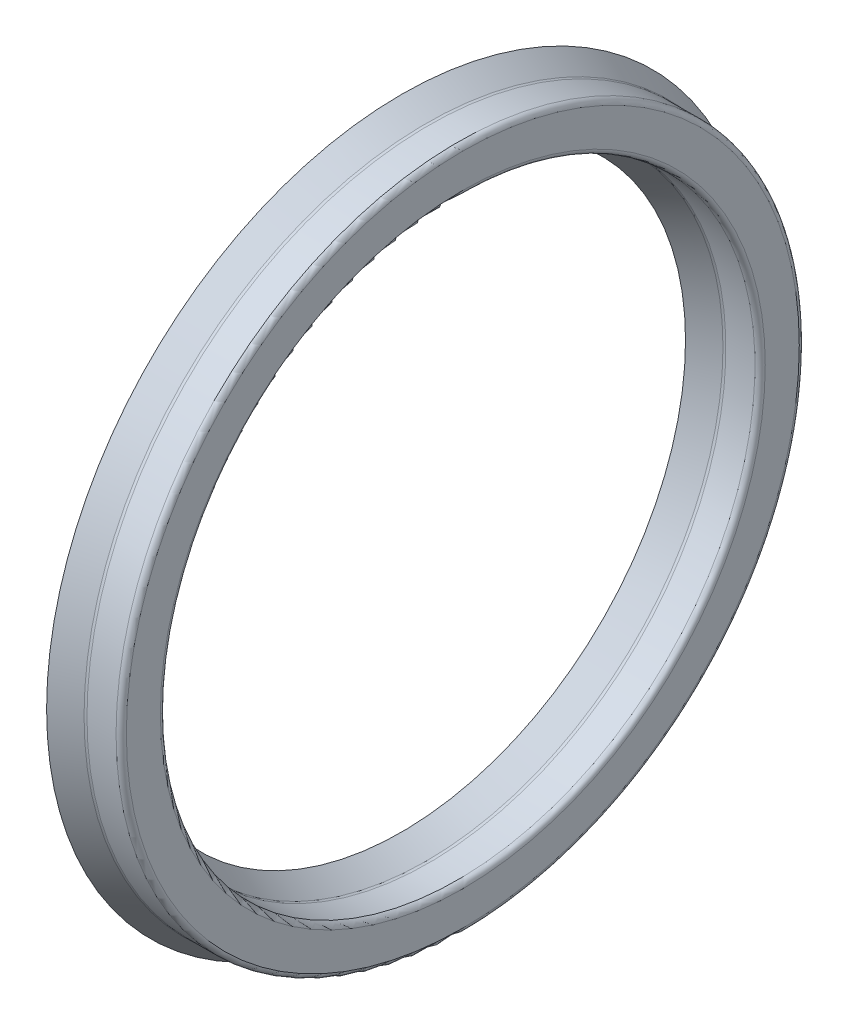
ISO-10303-21;
HEADER;
FILE_DESCRIPTION(('STEP AP214'),'2;1');
FILE_NAME('part.step','',(''),(''),'','','');
FILE_SCHEMA(('AUTOMOTIVE_DESIGN { 1 0 10303 214 1 1 1 1 }'));
ENDSEC;
DATA;
#1=APPLICATION_CONTEXT('core data for automotive mechanical design processes');
#2=APPLICATION_PROTOCOL_DEFINITION('international standard','automotive_design',2000,#1);
#3=PRODUCT_CONTEXT('',#1,'mechanical');
#4=PRODUCT('Part','Part','',(#3));
#5=PRODUCT_RELATED_PRODUCT_CATEGORY('part','',(#4));
#6=PRODUCT_DEFINITION_FORMATION('','',#4);
#7=PRODUCT_DEFINITION_CONTEXT('part definition',#1,'design');
#8=PRODUCT_DEFINITION('design','',#6,#7);
#9=PRODUCT_DEFINITION_SHAPE('','',#8);
#10=(LENGTH_UNIT() NAMED_UNIT(*) SI_UNIT(.MILLI.,.METRE.));
#11=(NAMED_UNIT(*) PLANE_ANGLE_UNIT() SI_UNIT($,.RADIAN.));
#12=(NAMED_UNIT(*) SI_UNIT($,.STERADIAN.) SOLID_ANGLE_UNIT());
#13=UNCERTAINTY_MEASURE_WITH_UNIT(LENGTH_MEASURE(1.E-05),#10,'distance_accuracy_value','');
#14=(GEOMETRIC_REPRESENTATION_CONTEXT(3) GLOBAL_UNCERTAINTY_ASSIGNED_CONTEXT((#13)) GLOBAL_UNIT_ASSIGNED_CONTEXT((#10,
#11,#12)) REPRESENTATION_CONTEXT('',''));
#15=CARTESIAN_POINT('',(0.,0.,0.));
#16=DIRECTION('',(0.,0.,1.));
#17=DIRECTION('',(1.,0.,0.));
#18=AXIS2_PLACEMENT_3D('',#15,#16,#17);
#19=CARTESIAN_POINT('',(-1.73443877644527,0.,0.));
#20=DIRECTION('',(1.,0.,0.));
#21=DIRECTION('',(0.,0.,-1.));
#22=AXIS2_PLACEMENT_3D('',#19,#20,#21);
#23=CONICAL_SURFACE('',#22,23.8125,1.09308222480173);
#24=CARTESIAN_POINT('',(-2.37489999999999,0.,0.));
#25=DIRECTION('',(-1.,0.,0.));
#26=DIRECTION('',(0.,0.,1.));
#27=AXIS2_PLACEMENT_3D('',#24,#25,#26);
#28=CIRCLE('',#27,22.575393);
#29=CARTESIAN_POINT('',(-2.37489999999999,0.,-22.575393));
#30=VERTEX_POINT('',#29);
#31=EDGE_CURVE('E10',#30,#30,#28,.T.);
#32=CARTESIAN_POINT('',(-1.73443877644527,0.,0.));
#33=DIRECTION('',(-1.,0.,0.));
#34=DIRECTION('',(0.,0.,1.));
#35=AXIS2_PLACEMENT_3D('',#32,#33,#34);
#36=CIRCLE('',#35,23.8125);
#37=CARTESIAN_POINT('',(-1.73443877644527,0.,-23.8125));
#38=VERTEX_POINT('',#37);
#39=EDGE_CURVE('E100',#38,#38,#36,.T.);
#40=CARTESIAN_POINT('',(-2.37489999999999,0.,-22.575393));
#41=CARTESIAN_POINT('',(-2.36822852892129,0.,-22.58827953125));
#42=CARTESIAN_POINT('',(-2.3615570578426,0.,-22.6011660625));
#43=CARTESIAN_POINT('',(-2.34821411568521,0.,-22.626939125));
#44=CARTESIAN_POINT('',(-2.34154264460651,0.,-22.63982565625));
#45=CARTESIAN_POINT('',(-2.32819970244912,0.,-22.66559871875));
#46=CARTESIAN_POINT('',(-2.32152823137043,0.,-22.67848525));
#47=CARTESIAN_POINT('',(-2.30818528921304,0.,-22.7042583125));
#48=CARTESIAN_POINT('',(-2.30151381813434,0.,-22.71714484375));
#49=CARTESIAN_POINT('',(-2.28817087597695,0.,-22.74291790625));
#50=CARTESIAN_POINT('',(-2.28149940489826,0.,-22.7558044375));
#51=CARTESIAN_POINT('',(-2.26815646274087,0.,-22.7815775));
#52=CARTESIAN_POINT('',(-2.26148499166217,0.,-22.79446403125));
#53=CARTESIAN_POINT('',(-2.24814204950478,0.,-22.82023709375));
#54=CARTESIAN_POINT('',(-2.24147057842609,0.,-22.833123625));
#55=CARTESIAN_POINT('',(-2.2281276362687,0.,-22.8588966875));
#56=CARTESIAN_POINT('',(-2.22145616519,0.,-22.87178321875));
#57=CARTESIAN_POINT('',(-2.20811322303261,0.,-22.89755628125));
#58=CARTESIAN_POINT('',(-2.20144175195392,0.,-22.9104428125));
#59=CARTESIAN_POINT('',(-2.18809880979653,0.,-22.936215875));
#60=CARTESIAN_POINT('',(-2.18142733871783,0.,-22.94910240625));
#61=CARTESIAN_POINT('',(-2.16808439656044,0.,-22.97487546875));
#62=CARTESIAN_POINT('',(-2.16141292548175,0.,-22.987762));
#63=CARTESIAN_POINT('',(-2.14806998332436,0.,-23.0135350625));
#64=CARTESIAN_POINT('',(-2.14139851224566,0.,-23.02642159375));
#65=CARTESIAN_POINT('',(-2.12805557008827,0.,-23.05219465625));
#66=CARTESIAN_POINT('',(-2.12138409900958,0.,-23.0650811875));
#67=CARTESIAN_POINT('',(-2.10804115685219,0.,-23.09085425));
#68=CARTESIAN_POINT('',(-2.10136968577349,0.,-23.10374078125));
#69=CARTESIAN_POINT('',(-2.0880267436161,0.,-23.12951384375));
#70=CARTESIAN_POINT('',(-2.08135527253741,0.,-23.142400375));
#71=CARTESIAN_POINT('',(-2.06801233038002,0.,-23.1681734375));
#72=CARTESIAN_POINT('',(-2.06134085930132,0.,-23.18105996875));
#73=CARTESIAN_POINT('',(-2.04799791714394,0.,-23.20683303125));
#74=CARTESIAN_POINT('',(-2.04132644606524,0.,-23.2197195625));
#75=CARTESIAN_POINT('',(-2.02798350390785,0.,-23.245492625));
#76=CARTESIAN_POINT('',(-2.02131203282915,0.,-23.25837915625));
#77=CARTESIAN_POINT('',(-2.00796909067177,0.,-23.28415221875));
#78=CARTESIAN_POINT('',(-2.00129761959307,0.,-23.29703875));
#79=CARTESIAN_POINT('',(-1.98795467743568,0.,-23.3228118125));
#80=CARTESIAN_POINT('',(-1.98128320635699,0.,-23.33569834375));
#81=CARTESIAN_POINT('',(-1.9679402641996,0.,-23.36147140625));
#82=CARTESIAN_POINT('',(-1.9612687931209,0.,-23.3743579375));
#83=CARTESIAN_POINT('',(-1.94792585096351,0.,-23.400131));
#84=CARTESIAN_POINT('',(-1.94125437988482,0.,-23.41301753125));
#85=CARTESIAN_POINT('',(-1.92791143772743,0.,-23.43879059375));
#86=CARTESIAN_POINT('',(-1.92123996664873,0.,-23.451677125));
#87=CARTESIAN_POINT('',(-1.90789702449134,0.,-23.4774501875));
#88=CARTESIAN_POINT('',(-1.90122555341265,0.,-23.49033671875));
#89=CARTESIAN_POINT('',(-1.88788261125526,0.,-23.51610978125));
#90=CARTESIAN_POINT('',(-1.88121114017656,0.,-23.5289963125));
#91=CARTESIAN_POINT('',(-1.86786819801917,0.,-23.554769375));
#92=CARTESIAN_POINT('',(-1.86119672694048,0.,-23.56765590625));
#93=CARTESIAN_POINT('',(-1.84785378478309,0.,-23.59342896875));
#94=CARTESIAN_POINT('',(-1.84118231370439,0.,-23.6063155));
#95=CARTESIAN_POINT('',(-1.827839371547,0.,-23.6320885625));
#96=CARTESIAN_POINT('',(-1.82116790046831,0.,-23.64497509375));
#97=CARTESIAN_POINT('',(-1.80782495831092,0.,-23.67074815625));
#98=CARTESIAN_POINT('',(-1.80115348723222,0.,-23.6836346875));
#99=CARTESIAN_POINT('',(-1.78781054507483,0.,-23.70940775));
#100=CARTESIAN_POINT('',(-1.78113907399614,0.,-23.72229428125));
#101=CARTESIAN_POINT('',(-1.76779613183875,0.,-23.74806734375));
#102=CARTESIAN_POINT('',(-1.76112466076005,0.,-23.760953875));
#103=CARTESIAN_POINT('',(-1.74778171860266,0.,-23.7867269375));
#104=CARTESIAN_POINT('',(-1.74111024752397,0.,-23.79961346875));
#105=CARTESIAN_POINT('',(-1.73443877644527,0.,-23.8125));
#106=B_SPLINE_CURVE_WITH_KNOTS('',3,(#40,#41,#42,#43,#44,#45,#46,#47,#48,#49,#50,#51,#52,#53,
#54,#55,#56,#57,#58,#59,#60,#61,#62,#63,#64,#65,#66,#67,#68,#69,#70,#71,#72,#73,#74,#75,#76,#77,
#78,#79,#80,#81,#82,#83,#84,#85,#86,#87,#88,#89,#90,#91,#92,#93,#94,#95,#96,#97,#98,#99,#100,
#101,#102,#103,#104,#105),.UNSPECIFIED.,.F.,.F.,(4,2,2,2,2,2,2,2,2,2,2,2,2,2,2,2,2,2,2,2,2,2,2,
2,2,2,2,2,2,2,2,2,4),(0.,0.0435332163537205,0.087066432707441,0.130599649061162,
0.174132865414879,0.217666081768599,0.26119929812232,0.304732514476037,0.348265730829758,
0.391798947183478,0.435332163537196,0.478865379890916,0.522398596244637,0.565931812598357,
0.609465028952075,0.652998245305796,0.696531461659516,0.740064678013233,0.783597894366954,
0.827131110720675,0.870664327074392,0.914197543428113,0.957730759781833,1.00126397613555,
1.04479719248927,1.08833040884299,1.13186362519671,1.17539684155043,1.21893005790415,
1.26246327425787,1.30599649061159,1.34952970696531,1.39306292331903),.UNSPECIFIED.);
#107=EDGE_CURVE('BSEAM39',#30,#38,#106,.T.);
#108=ORIENTED_EDGE('',*,*,#31,.F.);
#109=ORIENTED_EDGE('',*,*,#39,.T.);
#110=ORIENTED_EDGE('',*,*,#107,.T.);
#111=ORIENTED_EDGE('',*,*,#107,.F.);
#112=EDGE_LOOP('',(#108,#110,#109,#111));
#113=FACE_BOUND('',#112,.T.);
#114=ADVANCED_FACE('F39',(#113),#23,.T.);
#115=CARTESIAN_POINT('',(-2.37489999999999,0.,0.));
#116=DIRECTION('',(-1.,0.,0.));
#117=DIRECTION('',(0.,0.,1.));
#118=AXIS2_PLACEMENT_3D('',#115,#116,#117);
#119=CONICAL_SURFACE('',#118,22.575393,0.477714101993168);
#120=CARTESIAN_POINT('',(-0.756215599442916,0.,0.));
#121=DIRECTION('',(-1.,0.,0.));
#122=DIRECTION('',(0.,0.,1.));
#123=AXIS2_PLACEMENT_3D('',#120,#121,#122);
#124=CIRCLE('',#123,21.7373857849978);
#125=CARTESIAN_POINT('',(-0.756215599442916,0.,21.7373857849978));
#126=VERTEX_POINT('',#125);
#127=EDGE_CURVE('E46',#126,#126,#124,.T.);
#128=ORIENTED_EDGE('',*,*,#127,.F.);
#129=EDGE_LOOP('',(#128));
#130=FACE_BOUND('',#129,.T.);
#131=ORIENTED_EDGE('',*,*,#31,.T.);
#132=EDGE_LOOP('',(#131));
#133=FACE_BOUND('',#132,.T.);
#134=ADVANCED_FACE('F175',(#130,#133),#119,.F.);
#135=CARTESIAN_POINT('',(-0.914704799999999,0.,0.));
#136=DIRECTION('',(-1.,0.,0.));
#137=DIRECTION('',(0.,0.,1.));
#138=AXIS2_PLACEMENT_3D('',#135,#136,#137);
#139=TOROIDAL_SURFACE('',#138,21.43125,0.344728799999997);
#140=CARTESIAN_POINT('',(-0.756215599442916,0.,0.));
#141=DIRECTION('',(-1.,0.,0.));
#142=DIRECTION('',(0.,0.,1.));
#143=AXIS2_PLACEMENT_3D('',#140,#141,#142);
#144=CIRCLE('',#143,21.1251142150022);
#145=CARTESIAN_POINT('',(-0.756215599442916,0.,-21.1251142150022));
#146=VERTEX_POINT('',#145);
#147=EDGE_CURVE('E52',#146,#146,#144,.T.);
#148=ORIENTED_EDGE('',*,*,#147,.F.);
#149=EDGE_LOOP('',(#148));
#150=FACE_BOUND('',#149,.T.);
#151=ORIENTED_EDGE('',*,*,#127,.T.);
#152=EDGE_LOOP('',(#151));
#153=FACE_BOUND('',#152,.T.);
#154=ADVANCED_FACE('F170',(#150,#153),#139,.F.);
#155=CARTESIAN_POINT('',(-0.756215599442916,0.,0.));
#156=DIRECTION('',(1.,0.,0.));
#157=DIRECTION('',(0.,0.,-1.));
#158=AXIS2_PLACEMENT_3D('',#155,#156,#157);
#159=CONICAL_SURFACE('',#158,21.1251142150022,0.477714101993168);
#160=CARTESIAN_POINT('',(-2.37489999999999,0.,0.));
#161=DIRECTION('',(-1.,0.,0.));
#162=DIRECTION('',(0.,0.,1.));
#163=AXIS2_PLACEMENT_3D('',#160,#161,#162);
#164=CIRCLE('',#163,20.287107);
#165=CARTESIAN_POINT('',(-2.37489999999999,0.,-20.287107));
#166=VERTEX_POINT('',#165);
#167=EDGE_CURVE('E58',#166,#166,#164,.T.);
#168=CARTESIAN_POINT('',(-2.37489999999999,0.,-20.287107));
#169=CARTESIAN_POINT('',(-2.35803870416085,0.,-20.2958362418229));
#170=CARTESIAN_POINT('',(-2.34117740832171,0.,-20.3045654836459));
#171=CARTESIAN_POINT('',(-2.30745481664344,0.,-20.3220239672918));
#172=CARTESIAN_POINT('',(-2.2905935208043,0.,-20.3307532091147));
#173=CARTESIAN_POINT('',(-2.25687092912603,0.,-20.3482116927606));
#174=CARTESIAN_POINT('',(-2.2400096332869,0.,-20.3569409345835));
#175=CARTESIAN_POINT('',(-2.20628704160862,0.,-20.3743994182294));
#176=CARTESIAN_POINT('',(-2.18942574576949,0.,-20.3831286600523));
#177=CARTESIAN_POINT('',(-2.15570315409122,0.,-20.4005871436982));
#178=CARTESIAN_POINT('',(-2.13884185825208,0.,-20.4093163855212));
#179=CARTESIAN_POINT('',(-2.10511926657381,0.,-20.426774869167));
#180=CARTESIAN_POINT('',(-2.08825797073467,0.,-20.43550411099));
#181=CARTESIAN_POINT('',(-2.0545353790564,0.,-20.4529625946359));
#182=CARTESIAN_POINT('',(-2.03767408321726,0.,-20.4616918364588));
#183=CARTESIAN_POINT('',(-2.00395149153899,0.,-20.4791503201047));
#184=CARTESIAN_POINT('',(-1.98709019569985,0.,-20.4878795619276));
#185=CARTESIAN_POINT('',(-1.95336760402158,0.,-20.5053380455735));
#186=CARTESIAN_POINT('',(-1.93650630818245,0.,-20.5140672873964));
#187=CARTESIAN_POINT('',(-1.90278371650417,0.,-20.5315257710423));
#188=CARTESIAN_POINT('',(-1.88592242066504,0.,-20.5402550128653));
#189=CARTESIAN_POINT('',(-1.85219982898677,0.,-20.5577134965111));
#190=CARTESIAN_POINT('',(-1.83533853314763,0.,-20.5664427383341));
#191=CARTESIAN_POINT('',(-1.80161594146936,0.,-20.5839012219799));
#192=CARTESIAN_POINT('',(-1.78475464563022,0.,-20.5926304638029));
#193=CARTESIAN_POINT('',(-1.75103205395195,0.,-20.6100889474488));
#194=CARTESIAN_POINT('',(-1.73417075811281,0.,-20.6188181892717));
#195=CARTESIAN_POINT('',(-1.70044816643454,0.,-20.6362766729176));
#196=CARTESIAN_POINT('',(-1.6835868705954,0.,-20.6450059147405));
#197=CARTESIAN_POINT('',(-1.64986427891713,0.,-20.6624643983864));
#198=CARTESIAN_POINT('',(-1.633002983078,0.,-20.6711936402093));
#199=CARTESIAN_POINT('',(-1.59928039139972,0.,-20.6886521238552));
#200=CARTESIAN_POINT('',(-1.58241909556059,0.,-20.6973813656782));
#201=CARTESIAN_POINT('',(-1.54869650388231,0.,-20.714839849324));
#202=CARTESIAN_POINT('',(-1.53183520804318,0.,-20.723569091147));
#203=CARTESIAN_POINT('',(-1.49811261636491,0.,-20.7410275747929));
#204=CARTESIAN_POINT('',(-1.48125132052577,0.,-20.7497568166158));
#205=CARTESIAN_POINT('',(-1.4475287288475,0.,-20.7672153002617));
#206=CARTESIAN_POINT('',(-1.43066743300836,0.,-20.7759445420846));
#207=CARTESIAN_POINT('',(-1.39694484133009,0.,-20.7934030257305));
#208=CARTESIAN_POINT('',(-1.38008354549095,0.,-20.8021322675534));
#209=CARTESIAN_POINT('',(-1.34636095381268,0.,-20.8195907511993));
#210=CARTESIAN_POINT('',(-1.32949965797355,0.,-20.8283199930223));
#211=CARTESIAN_POINT('',(-1.29577706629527,0.,-20.8457784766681));
#212=CARTESIAN_POINT('',(-1.27891577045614,0.,-20.8545077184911));
#213=CARTESIAN_POINT('',(-1.24519317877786,0.,-20.871966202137));
#214=CARTESIAN_POINT('',(-1.22833188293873,0.,-20.8806954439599));
#215=CARTESIAN_POINT('',(-1.19460929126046,0.,-20.8981539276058));
#216=CARTESIAN_POINT('',(-1.17774799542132,0.,-20.9068831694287));
#217=CARTESIAN_POINT('',(-1.14402540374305,0.,-20.9243416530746));
#218=CARTESIAN_POINT('',(-1.12716410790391,0.,-20.9330708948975));
#219=CARTESIAN_POINT('',(-1.09344151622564,0.,-20.9505293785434));
#220=CARTESIAN_POINT('',(-1.0765802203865,0.,-20.9592586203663));
#221=CARTESIAN_POINT('',(-1.04285762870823,0.,-20.9767171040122));
#222=CARTESIAN_POINT('',(-1.02599633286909,0.,-20.9854463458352));
#223=CARTESIAN_POINT('',(-0.992273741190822,0.,-21.002904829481));
#224=CARTESIAN_POINT('',(-0.975412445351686,0.,-21.011634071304));
#225=CARTESIAN_POINT('',(-0.941689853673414,0.,-21.0290925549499));
#226=CARTESIAN_POINT('',(-0.924828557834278,0.,-21.0378217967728));
#227=CARTESIAN_POINT('',(-0.891105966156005,0.,-21.0552802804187));
#228=CARTESIAN_POINT('',(-0.874244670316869,0.,-21.0640095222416));
#229=CARTESIAN_POINT('',(-0.840522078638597,0.,-21.0814680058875));
#230=CARTESIAN_POINT('',(-0.823660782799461,0.,-21.0901972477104));
#231=CARTESIAN_POINT('',(-0.789938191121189,0.,-21.1076557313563));
#232=CARTESIAN_POINT('',(-0.773076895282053,0.,-21.1163849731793));
#233=CARTESIAN_POINT('',(-0.756215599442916,0.,-21.1251142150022));
#234=B_SPLINE_CURVE_WITH_KNOTS('',3,(#168,#169,#170,#171,#172,#173,#174,#175,#176,#177,#178,
#179,#180,#181,#182,#183,#184,#185,#186,#187,#188,#189,#190,#191,#192,#193,#194,#195,#196,#197,
#198,#199,#200,#201,#202,#203,#204,#205,#206,#207,#208,#209,#210,#211,#212,#213,#214,#215,#216,
#217,#218,#219,#220,#221,#222,#223,#224,#225,#226,#227,#228,#229,#230,#231,#232,#233),
.UNSPECIFIED.,.F.,.F.,(4,2,2,2,2,2,2,2,2,2,2,2,2,2,2,2,2,2,2,2,2,2,2,2,2,2,2,2,2,2,2,2,4),(0.,
0.0569607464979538,0.113921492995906,0.17088223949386,0.227842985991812,0.284803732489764,
0.341764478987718,0.39872522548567,0.455685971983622,0.512646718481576,0.569607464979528,
0.626568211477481,0.683528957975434,0.740489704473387,0.79745045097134,0.854411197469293,
0.911371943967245,0.968332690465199,1.02529343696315,1.0822541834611,1.13921492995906,
1.19617567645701,1.25313642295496,1.31009716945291,1.36705791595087,1.42401866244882,
1.48097940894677,1.53794015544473,1.59490090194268,1.65186164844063,1.70882239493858,
1.76578314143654,1.82274388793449),.UNSPECIFIED.);
#235=EDGE_CURVE('BSEAM164',#166,#146,#234,.T.);
#236=ORIENTED_EDGE('',*,*,#167,.F.);
#237=ORIENTED_EDGE('',*,*,#147,.T.);
#238=ORIENTED_EDGE('',*,*,#235,.T.);
#239=ORIENTED_EDGE('',*,*,#235,.F.);
#240=EDGE_LOOP('',(#236,#238,#237,#239));
#241=FACE_BOUND('',#240,.T.);
#242=ADVANCED_FACE('F164',(#241),#159,.T.);
#243=CARTESIAN_POINT('',(-2.37489999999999,0.,0.));
#244=DIRECTION('',(-1.,0.,0.));
#245=DIRECTION('',(0.,0.,1.));
#246=AXIS2_PLACEMENT_3D('',#243,#244,#245);
#247=CONICAL_SURFACE('',#246,20.287107,1.09308222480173);
#248=CARTESIAN_POINT('',(-1.73443877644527,0.,0.));
#249=DIRECTION('',(-1.,0.,0.));
#250=DIRECTION('',(0.,0.,1.));
#251=AXIS2_PLACEMENT_3D('',#248,#249,#250);
#252=CIRCLE('',#251,19.05);
#253=CARTESIAN_POINT('',(-1.73443877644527,0.,-19.05));
#254=VERTEX_POINT('',#253);
#255=EDGE_CURVE('E64',#254,#254,#252,.T.);
#256=ORIENTED_EDGE('',*,*,#255,.F.);
#257=EDGE_LOOP('',(#256));
#258=FACE_BOUND('',#257,.T.);
#259=ORIENTED_EDGE('',*,*,#167,.T.);
#260=EDGE_LOOP('',(#259));
#261=FACE_BOUND('',#260,.T.);
#262=ADVANCED_FACE('F158',(#258,#261),#247,.F.);
#263=CARTESIAN_POINT('',(-1.73443877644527,0.,0.));
#264=DIRECTION('',(1.,0.,0.));
#265=DIRECTION('',(0.,0.,-1.));
#266=AXIS2_PLACEMENT_3D('',#263,#264,#265);
#267=CONICAL_SURFACE('',#266,19.05,0.477714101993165);
#268=CARTESIAN_POINT('',(-0.0795375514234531,0.,0.));
#269=DIRECTION('',(-1.,0.,0.));
#270=DIRECTION('',(0.,0.,1.));
#271=AXIS2_PLACEMENT_3D('',#268,#269,#270);
#272=CIRCLE('',#271,19.9067569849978);
#273=CARTESIAN_POINT('',(-0.0795375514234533,0.,-19.9067569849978));
#274=VERTEX_POINT('',#273);
#275=EDGE_CURVE('E68',#274,#274,#272,.T.);
#276=CARTESIAN_POINT('',(-0.0795375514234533,0.,-19.9067569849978));
#277=CARTESIAN_POINT('',(-0.0967761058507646,0.,-19.8978324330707));
#278=CARTESIAN_POINT('',(-0.114014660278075,0.,-19.8889078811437));
#279=CARTESIAN_POINT('',(-0.148491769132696,0.,-19.8710587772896));
#280=CARTESIAN_POINT('',(-0.165730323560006,0.,-19.8621342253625));
#281=CARTESIAN_POINT('',(-0.200207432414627,0.,-19.8442851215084));
#282=CARTESIAN_POINT('',(-0.217445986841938,0.,-19.8353605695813));
#283=CARTESIAN_POINT('',(-0.25192309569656,0.,-19.8175114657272));
#284=CARTESIAN_POINT('',(-0.269161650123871,0.,-19.8085869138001));
#285=CARTESIAN_POINT('',(-0.303638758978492,0.,-19.790737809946));
#286=CARTESIAN_POINT('',(-0.320877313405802,0.,-19.781813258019));
#287=CARTESIAN_POINT('',(-0.355354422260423,0.,-19.7639641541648));
#288=CARTESIAN_POINT('',(-0.372592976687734,0.,-19.7550396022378));
#289=CARTESIAN_POINT('',(-0.407070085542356,0.,-19.7371904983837));
#290=CARTESIAN_POINT('',(-0.424308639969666,0.,-19.7282659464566));
#291=CARTESIAN_POINT('',(-0.458785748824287,0.,-19.7104168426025));
#292=CARTESIAN_POINT('',(-0.476024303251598,0.,-19.7014922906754));
#293=CARTESIAN_POINT('',(-0.510501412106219,0.,-19.6836431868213));
#294=CARTESIAN_POINT('',(-0.52773996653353,0.,-19.6747186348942));
#295=CARTESIAN_POINT('',(-0.562217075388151,0.,-19.6568695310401));
#296=CARTESIAN_POINT('',(-0.579455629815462,0.,-19.647944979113));
#297=CARTESIAN_POINT('',(-0.613932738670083,0.,-19.6300958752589));
#298=CARTESIAN_POINT('',(-0.631171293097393,0.,-19.6211713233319));
#299=CARTESIAN_POINT('',(-0.665648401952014,0.,-19.6033222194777));
#300=CARTESIAN_POINT('',(-0.682886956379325,0.,-19.5943976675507));
#301=CARTESIAN_POINT('',(-0.717364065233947,0.,-19.5765485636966));
#302=CARTESIAN_POINT('',(-0.734602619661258,0.,-19.5676240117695));
#303=CARTESIAN_POINT('',(-0.769079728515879,0.,-19.5497749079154));
#304=CARTESIAN_POINT('',(-0.786318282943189,0.,-19.5408503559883));
#305=CARTESIAN_POINT('',(-0.82079539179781,0.,-19.5230012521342));
#306=CARTESIAN_POINT('',(-0.838033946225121,0.,-19.5140767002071));
#307=CARTESIAN_POINT('',(-0.872511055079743,0.,-19.496227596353));
#308=CARTESIAN_POINT('',(-0.889749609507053,0.,-19.487303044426));
#309=CARTESIAN_POINT('',(-0.924226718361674,0.,-19.4694539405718));
#310=CARTESIAN_POINT('',(-0.941465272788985,0.,-19.4605293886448));
#311=CARTESIAN_POINT('',(-0.975942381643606,0.,-19.4426802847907));
#312=CARTESIAN_POINT('',(-0.993180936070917,0.,-19.4337557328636));
#313=CARTESIAN_POINT('',(-1.02765804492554,0.,-19.4159066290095));
#314=CARTESIAN_POINT('',(-1.04489659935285,0.,-19.4069820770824));
#315=CARTESIAN_POINT('',(-1.07937370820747,0.,-19.3891329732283));
#316=CARTESIAN_POINT('',(-1.09661226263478,0.,-19.3802084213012));
#317=CARTESIAN_POINT('',(-1.1310893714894,0.,-19.3623593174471));
#318=CARTESIAN_POINT('',(-1.14832792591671,0.,-19.3534347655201));
#319=CARTESIAN_POINT('',(-1.18280503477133,0.,-19.3355856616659));
#320=CARTESIAN_POINT('',(-1.20004358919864,0.,-19.3266611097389));
#321=CARTESIAN_POINT('',(-1.23452069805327,0.,-19.3088120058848));
#322=CARTESIAN_POINT('',(-1.25175925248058,0.,-19.2998874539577));
#323=CARTESIAN_POINT('',(-1.2862363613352,0.,-19.2820383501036));
#324=CARTESIAN_POINT('',(-1.30347491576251,0.,-19.2731137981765));
#325=CARTESIAN_POINT('',(-1.33795202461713,0.,-19.2552646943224));
#326=CARTESIAN_POINT('',(-1.35519057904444,0.,-19.2463401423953));
#327=CARTESIAN_POINT('',(-1.38966768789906,0.,-19.2284910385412));
#328=CARTESIAN_POINT('',(-1.40690624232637,0.,-19.2195664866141));
#329=CARTESIAN_POINT('',(-1.44138335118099,0.,-19.20171738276));
#330=CARTESIAN_POINT('',(-1.4586219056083,0.,-19.192792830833));
#331=CARTESIAN_POINT('',(-1.49309901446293,0.,-19.1749437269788));
#332=CARTESIAN_POINT('',(-1.51033756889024,0.,-19.1660191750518));
#333=CARTESIAN_POINT('',(-1.54481467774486,0.,-19.1481700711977));
#334=CARTESIAN_POINT('',(-1.56205323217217,0.,-19.1392455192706));
#335=CARTESIAN_POINT('',(-1.59653034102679,0.,-19.1213964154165));
#336=CARTESIAN_POINT('',(-1.6137688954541,0.,-19.1124718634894));
#337=CARTESIAN_POINT('',(-1.64824600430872,0.,-19.0946227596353));
#338=CARTESIAN_POINT('',(-1.66548455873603,0.,-19.0856982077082));
#339=CARTESIAN_POINT('',(-1.69996166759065,0.,-19.0678491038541));
#340=CARTESIAN_POINT('',(-1.71720022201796,0.,-19.0589245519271));
#341=CARTESIAN_POINT('',(-1.73443877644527,0.,-19.05));
#342=B_SPLINE_CURVE_WITH_KNOTS('',3,(#276,#277,#278,#279,#280,#281,#282,#283,#284,#285,#286,
#287,#288,#289,#290,#291,#292,#293,#294,#295,#296,#297,#298,#299,#300,#301,#302,#303,#304,#305,
#306,#307,#308,#309,#310,#311,#312,#313,#314,#315,#316,#317,#318,#319,#320,#321,#322,#323,#324,
#325,#326,#327,#328,#329,#330,#331,#332,#333,#334,#335,#336,#337,#338,#339,#340,#341),
.UNSPECIFIED.,.F.,.F.,(4,2,2,2,2,2,2,2,2,2,2,2,2,2,2,2,2,2,2,2,2,2,2,2,2,2,2,2,2,2,2,2,4),(0.,
0.0582351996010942,0.11647039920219,0.174705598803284,0.232940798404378,0.291175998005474,
0.349411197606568,0.407646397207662,0.465881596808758,0.524116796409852,0.582351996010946,
0.640587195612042,0.698822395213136,0.757057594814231,0.815292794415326,0.87352799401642,
0.931763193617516,0.98999839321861,1.0482335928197,1.1064687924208,1.16470399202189,
1.22293919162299,1.28117439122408,1.33940959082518,1.39764479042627,1.45587999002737,
1.51411518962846,1.57235038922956,1.63058558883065,1.68882078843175,1.74705598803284,
1.80529118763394,1.86352638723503),.UNSPECIFIED.);
#343=EDGE_CURVE('BSEAM152',#274,#254,#342,.T.);
#344=ORIENTED_EDGE('',*,*,#275,.F.);
#345=ORIENTED_EDGE('',*,*,#255,.T.);
#346=ORIENTED_EDGE('',*,*,#343,.T.);
#347=ORIENTED_EDGE('',*,*,#343,.F.);
#348=EDGE_LOOP('',(#344,#346,#345,#347));
#349=FACE_BOUND('',#348,.T.);
#350=ADVANCED_FACE('F152',(#349),#267,.F.);
#351=CARTESIAN_POINT('',(0.0789516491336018,0.,0.));
#352=DIRECTION('',(-1.,0.,0.));
#353=DIRECTION('',(0.,0.,1.));
#354=AXIS2_PLACEMENT_3D('',#351,#352,#353);
#355=TOROIDAL_SURFACE('',#354,19.6006212,0.344728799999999);
#356=CARTESIAN_POINT('',(0.0789516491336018,0.,0.));
#357=DIRECTION('',(-1.,0.,0.));
#358=DIRECTION('',(0.,0.,1.));
#359=AXIS2_PLACEMENT_3D('',#356,#357,#358);
#360=CIRCLE('',#359,19.94535);
#361=CARTESIAN_POINT('',(0.0789516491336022,0.,19.94535));
#362=VERTEX_POINT('',#361);
#363=EDGE_CURVE('E72',#362,#362,#360,.T.);
#364=ORIENTED_EDGE('',*,*,#363,.F.);
#365=EDGE_LOOP('',(#364));
#366=FACE_BOUND('',#365,.T.);
#367=ORIENTED_EDGE('',*,*,#275,.T.);
#368=EDGE_LOOP('',(#367));
#369=FACE_BOUND('',#368,.T.);
#370=ADVANCED_FACE('F146',(#366,#369),#355,.F.);
#371=CARTESIAN_POINT('',(-2.37489999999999,0.,0.));
#372=DIRECTION('',(-1.,0.,0.));
#373=DIRECTION('',(0.,0.,1.));
#374=AXIS2_PLACEMENT_3D('',#371,#372,#373);
#375=CYLINDRICAL_SURFACE('',#374,19.94535);
#376=CARTESIAN_POINT('',(2.03017119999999,0.,0.));
#377=DIRECTION('',(-1.,0.,0.));
#378=DIRECTION('',(0.,0.,1.));
#379=AXIS2_PLACEMENT_3D('',#376,#377,#378);
#380=CIRCLE('',#379,19.94535);
#381=CARTESIAN_POINT('',(2.03017119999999,0.,19.94535));
#382=VERTEX_POINT('',#381);
#383=EDGE_CURVE('E76',#382,#382,#380,.T.);
#384=CARTESIAN_POINT('',(2.03017119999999,0.,19.94535));
#385=CARTESIAN_POINT('',(2.00984599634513,0.,19.94535));
#386=CARTESIAN_POINT('',(1.98952079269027,0.,19.94535));
#387=CARTESIAN_POINT('',(1.94887038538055,0.,19.94535));
#388=CARTESIAN_POINT('',(1.9285451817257,0.,19.94535));
#389=CARTESIAN_POINT('',(1.88789477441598,0.,19.94535));
#390=CARTESIAN_POINT('',(1.86756957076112,0.,19.94535));
#391=CARTESIAN_POINT('',(1.8269191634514,0.,19.94535));
#392=CARTESIAN_POINT('',(1.80659395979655,0.,19.94535));
#393=CARTESIAN_POINT('',(1.76594355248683,0.,19.94535));
#394=CARTESIAN_POINT('',(1.74561834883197,0.,19.94535));
#395=CARTESIAN_POINT('',(1.70496794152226,0.,19.94535));
#396=CARTESIAN_POINT('',(1.6846427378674,0.,19.94535));
#397=CARTESIAN_POINT('',(1.64399233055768,0.,19.94535));
#398=CARTESIAN_POINT('',(1.62366712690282,0.,19.94535));
#399=CARTESIAN_POINT('',(1.58301671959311,0.,19.94535));
#400=CARTESIAN_POINT('',(1.56269151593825,0.,19.94535));
#401=CARTESIAN_POINT('',(1.52204110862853,0.,19.94535));
#402=CARTESIAN_POINT('',(1.50171590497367,0.,19.94535));
#403=CARTESIAN_POINT('',(1.46106549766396,0.,19.94535));
#404=CARTESIAN_POINT('',(1.4407402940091,0.,19.94535));
#405=CARTESIAN_POINT('',(1.40008988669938,0.,19.94535));
#406=CARTESIAN_POINT('',(1.37976468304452,0.,19.94535));
#407=CARTESIAN_POINT('',(1.33911427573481,0.,19.94535));
#408=CARTESIAN_POINT('',(1.31878907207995,0.,19.94535));
#409=CARTESIAN_POINT('',(1.27813866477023,0.,19.94535));
#410=CARTESIAN_POINT('',(1.25781346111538,0.,19.94535));
#411=CARTESIAN_POINT('',(1.21716305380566,0.,19.94535));
#412=CARTESIAN_POINT('',(1.1968378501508,0.,19.94535));
#413=CARTESIAN_POINT('',(1.15618744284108,0.,19.94535));
#414=CARTESIAN_POINT('',(1.13586223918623,0.,19.94535));
#415=CARTESIAN_POINT('',(1.09521183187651,0.,19.94535));
#416=CARTESIAN_POINT('',(1.07488662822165,0.,19.94535));
#417=CARTESIAN_POINT('',(1.03423622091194,0.,19.94535));
#418=CARTESIAN_POINT('',(1.01391101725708,0.,19.94535));
#419=CARTESIAN_POINT('',(0.973260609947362,0.,19.94535));
#420=CARTESIAN_POINT('',(0.952935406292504,0.,19.94535));
#421=CARTESIAN_POINT('',(0.912284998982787,0.,19.94535));
#422=CARTESIAN_POINT('',(0.891959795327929,0.,19.94535));
#423=CARTESIAN_POINT('',(0.851309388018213,0.,19.94535));
#424=CARTESIAN_POINT('',(0.830984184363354,0.,19.94535));
#425=CARTESIAN_POINT('',(0.790333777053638,0.,19.94535));
#426=CARTESIAN_POINT('',(0.77000857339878,0.,19.94535));
#427=CARTESIAN_POINT('',(0.729358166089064,0.,19.94535));
#428=CARTESIAN_POINT('',(0.709032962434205,0.,19.94535));
#429=CARTESIAN_POINT('',(0.668382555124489,0.,19.94535));
#430=CARTESIAN_POINT('',(0.648057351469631,0.,19.94535));
#431=CARTESIAN_POINT('',(0.607406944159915,0.,19.94535));
#432=CARTESIAN_POINT('',(0.587081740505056,0.,19.94535));
#433=CARTESIAN_POINT('',(0.54643133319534,0.,19.94535));
#434=CARTESIAN_POINT('',(0.526106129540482,0.,19.94535));
#435=CARTESIAN_POINT('',(0.485455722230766,0.,19.94535));
#436=CARTESIAN_POINT('',(0.465130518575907,0.,19.94535));
#437=CARTESIAN_POINT('',(0.424480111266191,0.,19.94535));
#438=CARTESIAN_POINT('',(0.404154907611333,0.,19.94535));
#439=CARTESIAN_POINT('',(0.363504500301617,0.,19.94535));
#440=CARTESIAN_POINT('',(0.343179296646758,0.,19.94535));
#441=CARTESIAN_POINT('',(0.302528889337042,0.,19.94535));
#442=CARTESIAN_POINT('',(0.282203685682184,0.,19.94535));
#443=CARTESIAN_POINT('',(0.241553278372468,0.,19.94535));
#444=CARTESIAN_POINT('',(0.221228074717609,0.,19.94535));
#445=CARTESIAN_POINT('',(0.180577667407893,0.,19.94535));
#446=CARTESIAN_POINT('',(0.160252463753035,0.,19.94535));
#447=CARTESIAN_POINT('',(0.119602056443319,0.,19.94535));
#448=CARTESIAN_POINT('',(0.0992768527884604,0.,19.94535));
#449=CARTESIAN_POINT('',(0.0789516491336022,0.,19.94535));
#450=B_SPLINE_CURVE_WITH_KNOTS('',3,(#384,#385,#386,#387,#388,#389,#390,#391,#392,#393,#394,
#395,#396,#397,#398,#399,#400,#401,#402,#403,#404,#405,#406,#407,#408,#409,#410,#411,#412,#413,
#414,#415,#416,#417,#418,#419,#420,#421,#422,#423,#424,#425,#426,#427,#428,#429,#430,#431,#432,
#433,#434,#435,#436,#437,#438,#439,#440,#441,#442,#443,#444,#445,#446,#447,#448,#449),
.UNSPECIFIED.,.F.,.F.,(4,2,2,2,2,2,2,2,2,2,2,2,2,2,2,2,2,2,2,2,2,2,2,2,2,2,2,2,2,2,2,2,4),(0.,
0.0609756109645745,0.121951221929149,0.182926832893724,0.243902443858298,0.304878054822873,
0.365853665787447,0.426829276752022,0.487804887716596,0.548780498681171,0.609756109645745,
0.67073172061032,0.731707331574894,0.792682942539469,0.853658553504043,0.914634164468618,
0.975609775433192,1.03658538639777,1.09756099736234,1.15853660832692,1.21951221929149,
1.28048783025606,1.34146344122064,1.40243905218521,1.46341466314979,1.52439027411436,
1.58536588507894,1.64634149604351,1.70731710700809,1.76829271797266,1.82926832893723,
1.89024393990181,1.95121955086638),.UNSPECIFIED.);
#451=EDGE_CURVE('BSEAM140',#382,#362,#450,.T.);
#452=ORIENTED_EDGE('',*,*,#383,.F.);
#453=ORIENTED_EDGE('',*,*,#363,.T.);
#454=ORIENTED_EDGE('',*,*,#451,.T.);
#455=ORIENTED_EDGE('',*,*,#451,.F.);
#456=EDGE_LOOP('',(#452,#454,#453,#455));
#457=FACE_BOUND('',#456,.T.);
#458=ADVANCED_FACE('F140',(#457),#375,.F.);
#459=CARTESIAN_POINT('',(2.03017119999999,0.,0.));
#460=DIRECTION('',(-1.,0.,0.));
#461=DIRECTION('',(0.,0.,1.));
#462=AXIS2_PLACEMENT_3D('',#459,#460,#461);
#463=TOROIDAL_SURFACE('',#462,20.2900788,0.3447288);
#464=CARTESIAN_POINT('',(2.37489999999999,0.,0.));
#465=DIRECTION('',(-1.,0.,0.));
#466=DIRECTION('',(0.,0.,1.));
#467=AXIS2_PLACEMENT_3D('',#464,#465,#466);
#468=CIRCLE('',#467,20.2900788);
#469=CARTESIAN_POINT('',(2.37489999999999,0.,20.2900788));
#470=VERTEX_POINT('',#469);
#471=EDGE_CURVE('E80',#470,#470,#468,.T.);
#472=ORIENTED_EDGE('',*,*,#471,.F.);
#473=EDGE_LOOP('',(#472));
#474=FACE_BOUND('',#473,.T.);
#475=ORIENTED_EDGE('',*,*,#383,.T.);
#476=EDGE_LOOP('',(#475));
#477=FACE_BOUND('',#476,.T.);
#478=ADVANCED_FACE('F134',(#474,#477),#463,.T.);
#479=CARTESIAN_POINT('',(2.37489999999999,22.5724212,0.));
#480=DIRECTION('',(-1.,0.,0.));
#481=DIRECTION('',(0.,0.,1.));
#482=AXIS2_PLACEMENT_3D('',#479,#480,#481);
#483=PLANE('',#482);
#484=CARTESIAN_POINT('',(2.37489999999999,0.,0.));
#485=DIRECTION('',(-1.,0.,0.));
#486=DIRECTION('',(0.,0.,1.));
#487=AXIS2_PLACEMENT_3D('',#484,#485,#486);
#488=CIRCLE('',#487,22.5724212);
#489=CARTESIAN_POINT('',(2.37489999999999,0.,22.5724212));
#490=VERTEX_POINT('',#489);
#491=EDGE_CURVE('E84',#490,#490,#488,.T.);
#492=ORIENTED_EDGE('',*,*,#491,.F.);
#493=EDGE_LOOP('',(#492));
#494=FACE_BOUND('',#493,.T.);
#495=ORIENTED_EDGE('',*,*,#471,.T.);
#496=EDGE_LOOP('',(#495));
#497=FACE_BOUND('',#496,.T.);
#498=ADVANCED_FACE('F128',(#494,#497),#483,.F.);
#499=CARTESIAN_POINT('',(2.03017119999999,0.,0.));
#500=DIRECTION('',(-1.,0.,0.));
#501=DIRECTION('',(0.,0.,1.));
#502=AXIS2_PLACEMENT_3D('',#499,#500,#501);
#503=TOROIDAL_SURFACE('',#502,22.5724212,0.344728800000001);
#504=CARTESIAN_POINT('',(2.03017119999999,0.,0.));
#505=DIRECTION('',(-1.,0.,0.));
#506=DIRECTION('',(0.,0.,1.));
#507=AXIS2_PLACEMENT_3D('',#504,#505,#506);
#508=CIRCLE('',#507,22.91715);
#509=CARTESIAN_POINT('',(2.03017119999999,0.,22.91715));
#510=VERTEX_POINT('',#509);
#511=EDGE_CURVE('E88',#510,#510,#508,.T.);
#512=ORIENTED_EDGE('',*,*,#511,.F.);
#513=EDGE_LOOP('',(#512));
#514=FACE_BOUND('',#513,.T.);
#515=ORIENTED_EDGE('',*,*,#491,.T.);
#516=EDGE_LOOP('',(#515));
#517=FACE_BOUND('',#516,.T.);
#518=ADVANCED_FACE('F122',(#514,#517),#503,.T.);
#519=CARTESIAN_POINT('',(-2.37489999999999,0.,0.));
#520=DIRECTION('',(-1.,0.,0.));
#521=DIRECTION('',(0.,0.,1.));
#522=AXIS2_PLACEMENT_3D('',#519,#520,#521);
#523=CYLINDRICAL_SURFACE('',#522,22.91715);
#524=CARTESIAN_POINT('',(0.0789516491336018,0.,0.));
#525=DIRECTION('',(-1.,0.,0.));
#526=DIRECTION('',(0.,0.,1.));
#527=AXIS2_PLACEMENT_3D('',#524,#525,#526);
#528=CIRCLE('',#527,22.91715);
#529=CARTESIAN_POINT('',(0.0789516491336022,0.,22.91715));
#530=VERTEX_POINT('',#529);
#531=EDGE_CURVE('E92',#530,#530,#528,.T.);
#532=CARTESIAN_POINT('',(0.0789516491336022,0.,22.91715));
#533=CARTESIAN_POINT('',(0.0992768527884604,0.,22.91715));
#534=CARTESIAN_POINT('',(0.119602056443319,0.,22.91715));
#535=CARTESIAN_POINT('',(0.160252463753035,0.,22.91715));
#536=CARTESIAN_POINT('',(0.180577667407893,0.,22.91715));
#537=CARTESIAN_POINT('',(0.221228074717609,0.,22.91715));
#538=CARTESIAN_POINT('',(0.241553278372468,0.,22.91715));
#539=CARTESIAN_POINT('',(0.282203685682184,0.,22.91715));
#540=CARTESIAN_POINT('',(0.302528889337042,0.,22.91715));
#541=CARTESIAN_POINT('',(0.343179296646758,0.,22.91715));
#542=CARTESIAN_POINT('',(0.363504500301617,0.,22.91715));
#543=CARTESIAN_POINT('',(0.404154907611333,0.,22.91715));
#544=CARTESIAN_POINT('',(0.424480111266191,0.,22.91715));
#545=CARTESIAN_POINT('',(0.465130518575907,0.,22.91715));
#546=CARTESIAN_POINT('',(0.485455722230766,0.,22.91715));
#547=CARTESIAN_POINT('',(0.526106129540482,0.,22.91715));
#548=CARTESIAN_POINT('',(0.54643133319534,0.,22.91715));
#549=CARTESIAN_POINT('',(0.587081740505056,0.,22.91715));
#550=CARTESIAN_POINT('',(0.607406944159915,0.,22.91715));
#551=CARTESIAN_POINT('',(0.648057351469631,0.,22.91715));
#552=CARTESIAN_POINT('',(0.668382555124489,0.,22.91715));
#553=CARTESIAN_POINT('',(0.709032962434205,0.,22.91715));
#554=CARTESIAN_POINT('',(0.729358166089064,0.,22.91715));
#555=CARTESIAN_POINT('',(0.77000857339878,0.,22.91715));
#556=CARTESIAN_POINT('',(0.790333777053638,0.,22.91715));
#557=CARTESIAN_POINT('',(0.830984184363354,0.,22.91715));
#558=CARTESIAN_POINT('',(0.851309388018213,0.,22.91715));
#559=CARTESIAN_POINT('',(0.891959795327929,0.,22.91715));
#560=CARTESIAN_POINT('',(0.912284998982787,0.,22.91715));
#561=CARTESIAN_POINT('',(0.952935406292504,0.,22.91715));
#562=CARTESIAN_POINT('',(0.973260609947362,0.,22.91715));
#563=CARTESIAN_POINT('',(1.01391101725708,0.,22.91715));
#564=CARTESIAN_POINT('',(1.03423622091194,0.,22.91715));
#565=CARTESIAN_POINT('',(1.07488662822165,0.,22.91715));
#566=CARTESIAN_POINT('',(1.09521183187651,0.,22.91715));
#567=CARTESIAN_POINT('',(1.13586223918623,0.,22.91715));
#568=CARTESIAN_POINT('',(1.15618744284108,0.,22.91715));
#569=CARTESIAN_POINT('',(1.1968378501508,0.,22.91715));
#570=CARTESIAN_POINT('',(1.21716305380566,0.,22.91715));
#571=CARTESIAN_POINT('',(1.25781346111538,0.,22.91715));
#572=CARTESIAN_POINT('',(1.27813866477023,0.,22.91715));
#573=CARTESIAN_POINT('',(1.31878907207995,0.,22.91715));
#574=CARTESIAN_POINT('',(1.33911427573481,0.,22.91715));
#575=CARTESIAN_POINT('',(1.37976468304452,0.,22.91715));
#576=CARTESIAN_POINT('',(1.40008988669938,0.,22.91715));
#577=CARTESIAN_POINT('',(1.4407402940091,0.,22.91715));
#578=CARTESIAN_POINT('',(1.46106549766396,0.,22.91715));
#579=CARTESIAN_POINT('',(1.50171590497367,0.,22.91715));
#580=CARTESIAN_POINT('',(1.52204110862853,0.,22.91715));
#581=CARTESIAN_POINT('',(1.56269151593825,0.,22.91715));
#582=CARTESIAN_POINT('',(1.58301671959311,0.,22.91715));
#583=CARTESIAN_POINT('',(1.62366712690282,0.,22.91715));
#584=CARTESIAN_POINT('',(1.64399233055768,0.,22.91715));
#585=CARTESIAN_POINT('',(1.6846427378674,0.,22.91715));
#586=CARTESIAN_POINT('',(1.70496794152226,0.,22.91715));
#587=CARTESIAN_POINT('',(1.74561834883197,0.,22.91715));
#588=CARTESIAN_POINT('',(1.76594355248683,0.,22.91715));
#589=CARTESIAN_POINT('',(1.80659395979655,0.,22.91715));
#590=CARTESIAN_POINT('',(1.8269191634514,0.,22.91715));
#591=CARTESIAN_POINT('',(1.86756957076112,0.,22.91715));
#592=CARTESIAN_POINT('',(1.88789477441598,0.,22.91715));
#593=CARTESIAN_POINT('',(1.9285451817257,0.,22.91715));
#594=CARTESIAN_POINT('',(1.94887038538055,0.,22.91715));
#595=CARTESIAN_POINT('',(1.98952079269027,0.,22.91715));
#596=CARTESIAN_POINT('',(2.00984599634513,0.,22.91715));
#597=CARTESIAN_POINT('',(2.03017119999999,0.,22.91715));
#598=B_SPLINE_CURVE_WITH_KNOTS('',3,(#532,#533,#534,#535,#536,#537,#538,#539,#540,#541,#542,
#543,#544,#545,#546,#547,#548,#549,#550,#551,#552,#553,#554,#555,#556,#557,#558,#559,#560,#561,
#562,#563,#564,#565,#566,#567,#568,#569,#570,#571,#572,#573,#574,#575,#576,#577,#578,#579,#580,
#581,#582,#583,#584,#585,#586,#587,#588,#589,#590,#591,#592,#593,#594,#595,#596,#597),
.UNSPECIFIED.,.F.,.F.,(4,2,2,2,2,2,2,2,2,2,2,2,2,2,2,2,2,2,2,2,2,2,2,2,2,2,2,2,2,2,2,2,4),(0.,
0.0609756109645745,0.121951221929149,0.182926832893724,0.243902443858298,0.304878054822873,
0.365853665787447,0.426829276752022,0.487804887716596,0.548780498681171,0.609756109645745,
0.67073172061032,0.731707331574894,0.792682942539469,0.853658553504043,0.914634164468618,
0.975609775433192,1.03658538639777,1.09756099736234,1.15853660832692,1.21951221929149,
1.28048783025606,1.34146344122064,1.40243905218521,1.46341466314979,1.52439027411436,
1.58536588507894,1.64634149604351,1.70731710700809,1.76829271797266,1.82926832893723,
1.89024393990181,1.95121955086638),.UNSPECIFIED.);
#599=EDGE_CURVE('BSEAM116',#530,#510,#598,.T.);
#600=ORIENTED_EDGE('',*,*,#531,.F.);
#601=ORIENTED_EDGE('',*,*,#511,.T.);
#602=ORIENTED_EDGE('',*,*,#599,.T.);
#603=ORIENTED_EDGE('',*,*,#599,.F.);
#604=EDGE_LOOP('',(#600,#602,#601,#603));
#605=FACE_BOUND('',#604,.T.);
#606=ADVANCED_FACE('F116',(#605),#523,.T.);
#607=CARTESIAN_POINT('',(0.0789516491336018,0.,0.));
#608=DIRECTION('',(-1.,0.,0.));
#609=DIRECTION('',(0.,0.,1.));
#610=AXIS2_PLACEMENT_3D('',#607,#608,#609);
#611=TOROIDAL_SURFACE('',#610,23.2618788,0.344728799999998);
#612=CARTESIAN_POINT('',(-0.0795375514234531,0.,0.));
#613=DIRECTION('',(-1.,0.,0.));
#614=DIRECTION('',(0.,0.,1.));
#615=AXIS2_PLACEMENT_3D('',#612,#613,#614);
#616=CIRCLE('',#615,22.9557430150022);
#617=CARTESIAN_POINT('',(-0.0795375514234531,0.,22.9557430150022));
#618=VERTEX_POINT('',#617);
#619=EDGE_CURVE('E96',#618,#618,#616,.T.);
#620=ORIENTED_EDGE('',*,*,#619,.F.);
#621=EDGE_LOOP('',(#620));
#622=FACE_BOUND('',#621,.T.);
#623=ORIENTED_EDGE('',*,*,#531,.T.);
#624=EDGE_LOOP('',(#623));
#625=FACE_BOUND('',#624,.T.);
#626=ADVANCED_FACE('F110',(#622,#625),#611,.F.);
#627=CARTESIAN_POINT('',(-0.0795375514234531,0.,0.));
#628=DIRECTION('',(-1.,0.,0.));
#629=DIRECTION('',(0.,0.,1.));
#630=AXIS2_PLACEMENT_3D('',#627,#628,#629);
#631=CONICAL_SURFACE('',#630,22.9557430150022,0.47771410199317);
#632=ORIENTED_EDGE('',*,*,#39,.F.);
#633=EDGE_LOOP('',(#632));
#634=FACE_BOUND('',#633,.T.);
#635=ORIENTED_EDGE('',*,*,#619,.T.);
#636=EDGE_LOOP('',(#635));
#637=FACE_BOUND('',#636,.T.);
#638=ADVANCED_FACE('F107',(#634,#637),#631,.T.);
#639=CLOSED_SHELL('',(#114,#134,#154,#242,#262,#350,#370,#458,#478,#498,#518,#606,#626,#638));
#640=MANIFOLD_SOLID_BREP('B2',#639);
#641=ADVANCED_BREP_SHAPE_REPRESENTATION('',(#18,#640),#14);
#642=SHAPE_DEFINITION_REPRESENTATION(#9,#641);
ENDSEC;
END-ISO-10303-21;
